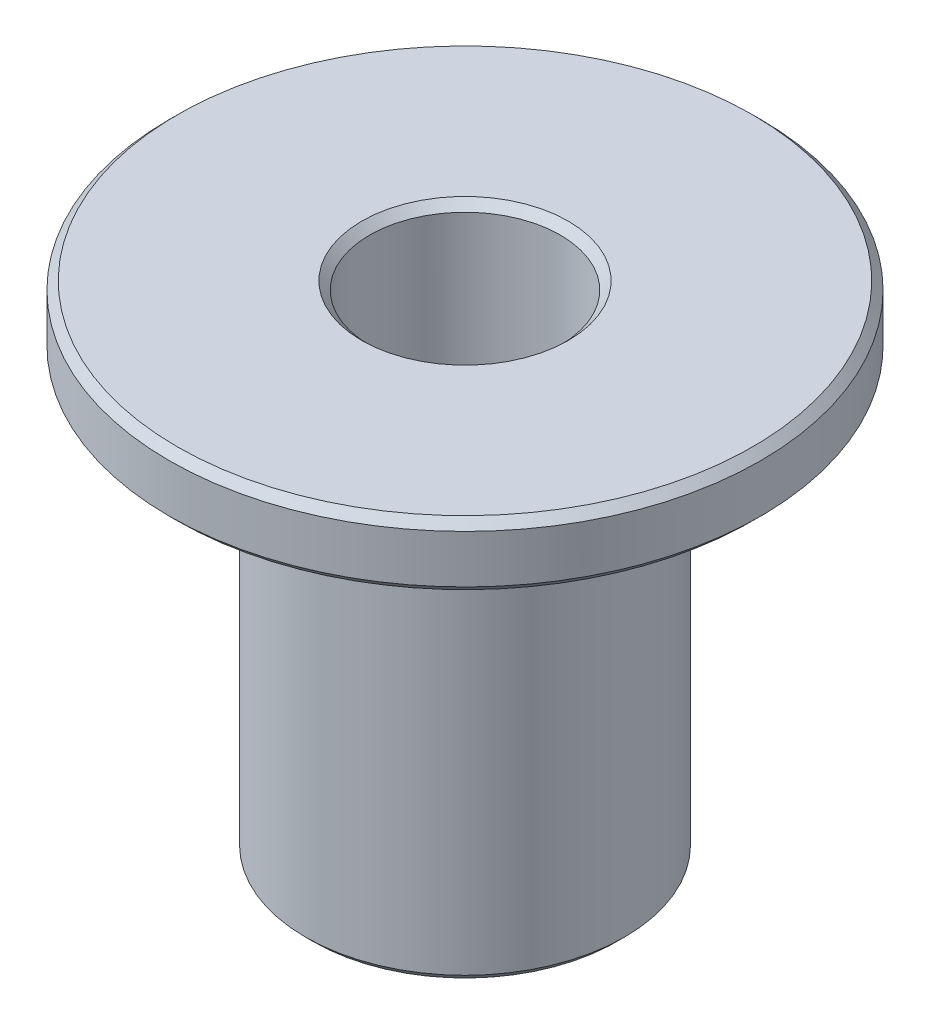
from build123d import *

# Parameters (mm, degrees)
CHANFREIN1_SIZE = 0.25


with BuildPart() as part:
    # Esquisse1 → Base-R_volution (revolve)
    with BuildSketch(Plane.XY, mode=Mode.PRIVATE) as base_r_volution_sk:
        Polygon((2.975, 14.5), (2.975, 30), (9.225, 30), (9.225, 28), (4.975, 28), (4.975, 14.5), align=None)
    revolve(base_r_volution_sk.sketch.rotate(Axis((0, 30, 0), (0, -1, 0)), 90), axis=Axis((0, 30, 0), (0, -1, 0)))

    # Chanfrein1
    chanfrein1_edges = [part.edges().sort_by_distance(p)[0] for p in [
        (0, 14.5, -2.975),
        (0, 30, -2.975),
        (0, 30, -9.225),
        (0, 28, -9.225),
        (0, 14.5, -4.975),
    ]]
    chamfer(chanfrein1_edges, length=CHANFREIN1_SIZE)


solid = part.part
